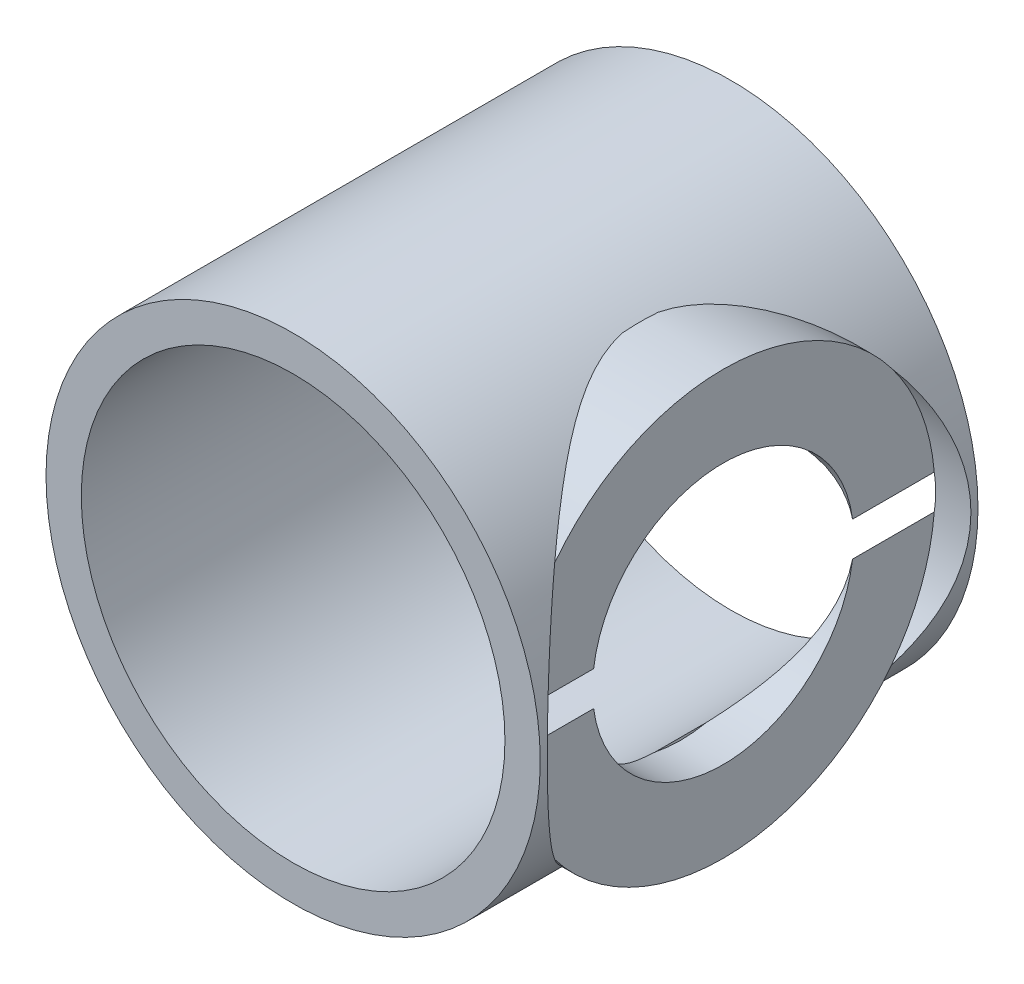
from build123d import *

# Parameters (mm, degrees)
SKETCH1_R           = 44.45
SKETCH1_R_2         = 38.1
BOSS_EXTRUDE1_DEPTH = 78.74
SKETCH2_R           = 38.1
BOSS_EXTRUDE2_DEPTH = 21.336
CUT_EXTRUDE1_START  = -134.366
SKETCH3_R           = 38.1
CUT_EXTRUDE1_DEPTH  = 134.366
SKETCH9_R           = 38.1
CUT_EXTRUDE9_DEPTH  = 6.477
SKETCH10_R          = 23.495
CUT_EXTRUDE10_DEPTH = 7.62


with BuildPart() as part:
    # Sketch1 → Boss-Extrude1 (new body)
    with BuildSketch(Plane.XY):
        Circle(SKETCH1_R)
        Circle(SKETCH1_R_2, mode=Mode.SUBTRACT)
    extrude(amount=BOSS_EXTRUDE1_DEPTH)

    # Sketch2 → Boss-Extrude2 (add)
    with BuildSketch(Plane(origin=(44.45, 0, 0), x_dir=(0, 0, -1), z_dir=(1, 0, 0))):
        with Locations((-39.37, 0)):
            Circle(SKETCH2_R)
    extrude(amount=-BOSS_EXTRUDE2_DEPTH)

    # Sketch3 → Cut-Extrude1 (cut)
    with BuildSketch(Plane.XY.offset(78.74).offset(CUT_EXTRUDE1_START)):
        Circle(SKETCH3_R)
    extrude(amount=CUT_EXTRUDE1_DEPTH, mode=Mode.SUBTRACT)

    # Sketch9 → Cut-Extrude9 (cut)
    with BuildSketch(Plane(origin=(44.45, 0, 0), x_dir=(0, 0, -1), z_dir=(1, 0, 0))):
        with Locations((-39.37, 0)):
            Circle(SKETCH9_R)
    extrude(amount=-CUT_EXTRUDE9_DEPTH, mode=Mode.SUBTRACT)

    # Sketch10 → Cut-Extrude10 (cut)
    with BuildSketch(Plane(origin=(37.973, 0, 0), x_dir=(0, 0, -1), z_dir=(1, 0, 0))):
        with Locations((-39.37, 0)):
            Circle(SKETCH10_R)
    extrude(amount=-CUT_EXTRUDE10_DEPTH, mode=Mode.SUBTRACT)


solid = part.part
